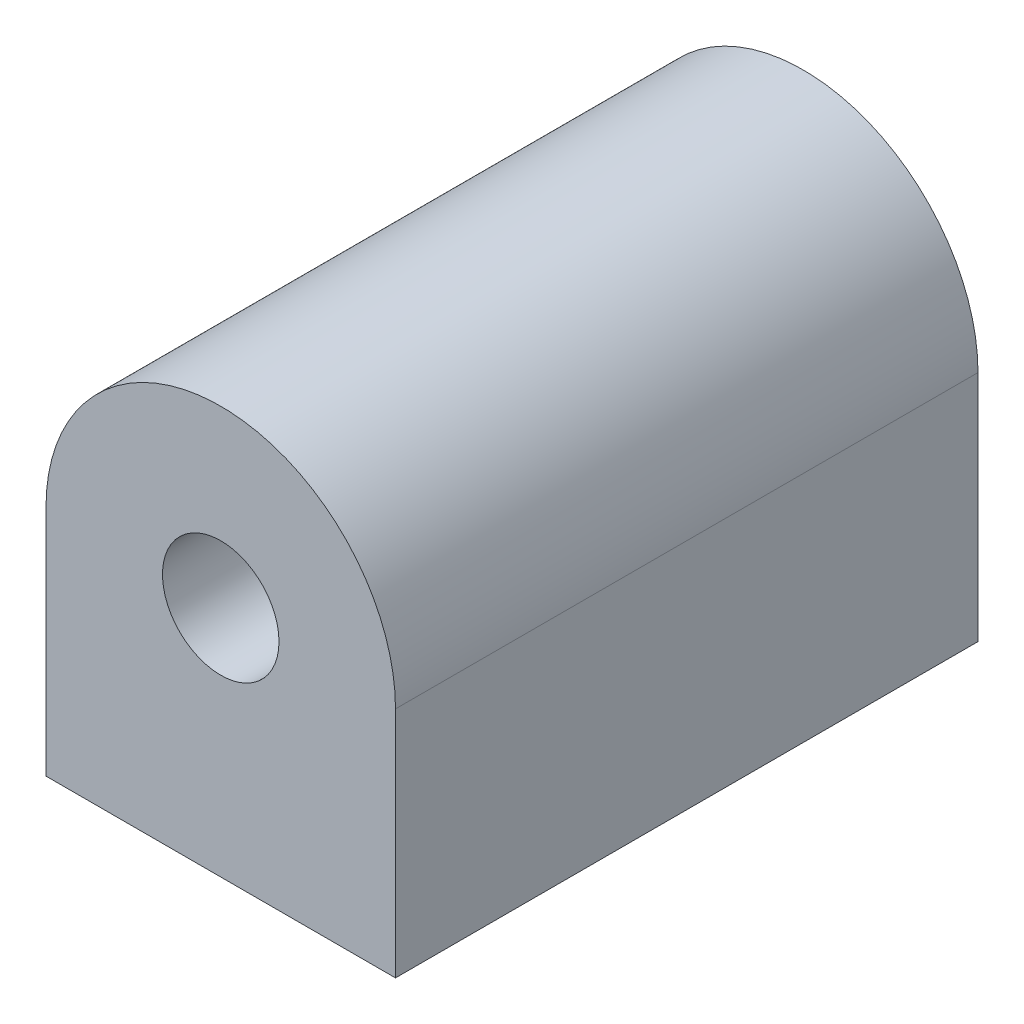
from build123d import *

# Parameters (mm, degrees)
BOSS_EXTRUDE1_DEPTH = 25
SKETCH2_R           = 5
CUT_EXTRUDE1_DEPTH  = 56.901699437


with BuildPart() as part:
    # Sketch1 → Boss-Extrude1 (new, symmetric)
    with BuildSketch(Plane.XY):
        with BuildLine():
            Line((-15, 0), (-15, -20))
            Line((-15, -20), (15, -20))
            Line((15, -20), (15, 0))
            ThreePointArc((15, 0), (0, 15), (-15, 0))
        make_face()
    extrude(amount=BOSS_EXTRUDE1_DEPTH, both=True)

    # Sketch2 → Cut-Extrude1 (cut, through all)
    with BuildSketch(Plane.XY.offset(25)):
        Circle(SKETCH2_R)
    extrude(amount=-CUT_EXTRUDE1_DEPTH, mode=Mode.SUBTRACT)


solid = part.part
